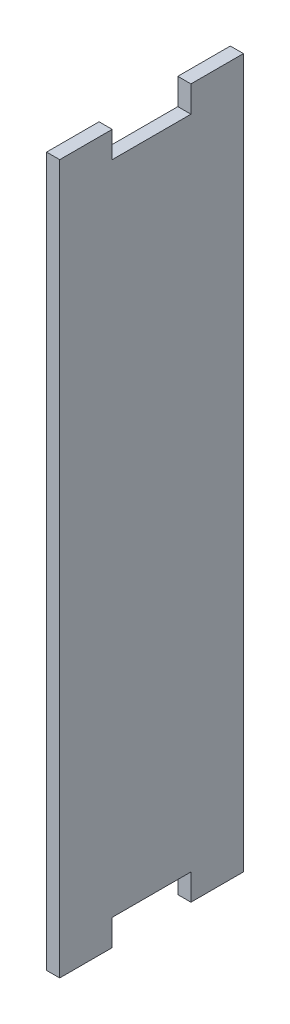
from build123d import *

# Parameters (mm, degrees)
EXTRUDE1_DEPTH = 3.175


with BuildPart() as part:
    # Sketch1 → Extrude1 (new body)
    with BuildSketch(Plane(origin=(0, 0, 0), x_dir=(0, 0, -1), z_dir=(1, 0, 0))):
        Polygon((-9.525, 0), (9.525, 0), (9.525, -6.35), (22.225, -6.35), (22.225, 165.1), (9.525, 165.1), (9.525, 158.75), (-9.525, 158.75), (-9.525, 165.1), (-22.225, 165.1), (-22.225, -6.35), (-9.525, -6.35), align=None)
    extrude(amount=EXTRUDE1_DEPTH)


solid = part.part
